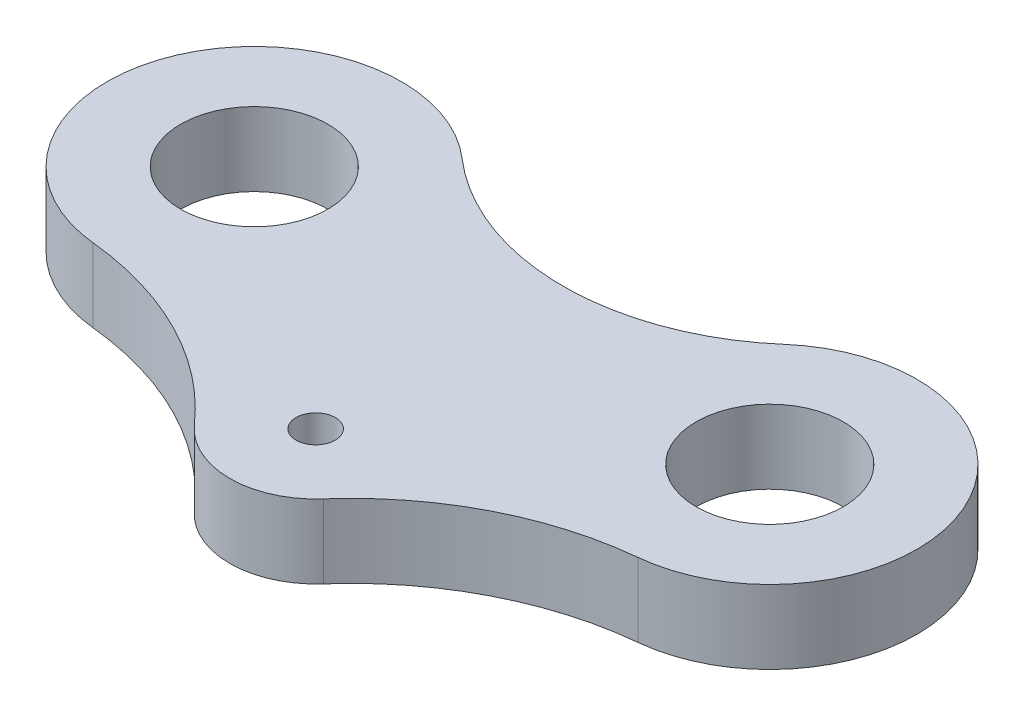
ISO-10303-21;
HEADER;
FILE_DESCRIPTION(('STEP AP214'),'2;1');
FILE_NAME('part.step','',(''),(''),'','','');
FILE_SCHEMA(('AUTOMOTIVE_DESIGN { 1 0 10303 214 1 1 1 1 }'));
ENDSEC;
DATA;
#1=APPLICATION_CONTEXT('core data for automotive mechanical design processes');
#2=APPLICATION_PROTOCOL_DEFINITION('international standard','automotive_design',2000,#1);
#3=PRODUCT_CONTEXT('',#1,'mechanical');
#4=PRODUCT('Part','Part','',(#3));
#5=PRODUCT_RELATED_PRODUCT_CATEGORY('part','',(#4));
#6=PRODUCT_DEFINITION_FORMATION('','',#4);
#7=PRODUCT_DEFINITION_CONTEXT('part definition',#1,'design');
#8=PRODUCT_DEFINITION('design','',#6,#7);
#9=PRODUCT_DEFINITION_SHAPE('','',#8);
#10=(LENGTH_UNIT() NAMED_UNIT(*) SI_UNIT(.MILLI.,.METRE.));
#11=(NAMED_UNIT(*) PLANE_ANGLE_UNIT() SI_UNIT($,.RADIAN.));
#12=(NAMED_UNIT(*) SI_UNIT($,.STERADIAN.) SOLID_ANGLE_UNIT());
#13=UNCERTAINTY_MEASURE_WITH_UNIT(LENGTH_MEASURE(1.E-05),#10,'distance_accuracy_value','');
#14=(GEOMETRIC_REPRESENTATION_CONTEXT(3) GLOBAL_UNCERTAINTY_ASSIGNED_CONTEXT((#13)) GLOBAL_UNIT_ASSIGNED_CONTEXT((#10,
#11,#12)) REPRESENTATION_CONTEXT('',''));
#15=CARTESIAN_POINT('',(0.,0.,0.));
#16=DIRECTION('',(0.,0.,1.));
#17=DIRECTION('',(1.,0.,0.));
#18=AXIS2_PLACEMENT_3D('',#15,#16,#17);
#19=CARTESIAN_POINT('',(26.2500000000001,15.0000000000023,-30.1817411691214));
#20=DIRECTION('',(0.,1.,0.));
#21=DIRECTION('',(0.,0.,1.));
#22=AXIS2_PLACEMENT_3D('',#19,#20,#21);
#23=PLANE('',#22);
#24=CARTESIAN_POINT('',(52.5000000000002,15.0000000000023,5.32907051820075E-12));
#25=DIRECTION('',(0.,1.,0.));
#26=DIRECTION('',(0.,0.,1.));
#27=AXIS2_PLACEMENT_3D('',#24,#25,#26);
#28=CIRCLE('',#27,15.);
#29=CARTESIAN_POINT('',(52.5000000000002,15.0000000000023,15.0000000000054));
#30=VERTEX_POINT('',#29);
#31=EDGE_CURVE('E183',#30,#30,#28,.T.);
#32=ORIENTED_EDGE('',*,*,#31,.F.);
#33=EDGE_LOOP('',(#32));
#34=FACE_BOUND('',#33,.T.);
#35=CARTESIAN_POINT('',(0.,15.0000000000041,-60.3634823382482));
#36=DIRECTION('',(0.,-1.,0.));
#37=DIRECTION('',(0.,0.,1.));
#38=AXIS2_PLACEMENT_3D('',#35,#36,#37);
#39=CIRCLE('',#38,50.);
#40=CARTESIAN_POINT('',(32.8125000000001,15.0000000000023,-22.6363058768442));
#41=VERTEX_POINT('',#40);
#42=CARTESIAN_POINT('',(-32.8125000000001,15.0000000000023,-22.6363058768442));
#43=VERTEX_POINT('',#42);
#44=EDGE_CURVE('E127',#41,#43,#39,.T.);
#45=ORIENTED_EDGE('',*,*,#44,.T.);
#46=CARTESIAN_POINT('',(-52.5000000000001,15.0000000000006,1.77635683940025E-12));
#47=DIRECTION('',(0.,1.,0.));
#48=DIRECTION('',(0.,0.,1.));
#49=AXIS2_PLACEMENT_3D('',#46,#47,#48);
#50=CIRCLE('',#49,30.);
#51=CARTESIAN_POINT('',(-55.47038996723,14.9999999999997,29.8525842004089));
#52=VERTEX_POINT('',#51);
#53=EDGE_CURVE('E85',#43,#52,#50,.T.);
#54=ORIENTED_EDGE('',*,*,#53,.T.);
#55=CARTESIAN_POINT('',(-61.9062348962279,15.0000000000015,94.5331833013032));
#56=DIRECTION('',(0.,-1.,0.));
#57=DIRECTION('',(0.,0.,1.));
#58=AXIS2_PLACEMENT_3D('',#55,#56,#57);
#59=CIRCLE('',#58,65.);
#60=CARTESIAN_POINT('',(-13.1316255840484,14.9999999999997,51.567644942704));
#61=VERTEX_POINT('',#60);
#62=EDGE_CURVE('E98',#52,#61,#59,.T.);
#63=ORIENTED_EDGE('',*,*,#62,.T.);
#64=CARTESIAN_POINT('',(0.,15.0000000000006,40.0000000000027));
#65=DIRECTION('',(0.,1.,0.));
#66=DIRECTION('',(0.,0.,1.));
#67=AXIS2_PLACEMENT_3D('',#64,#65,#66);
#68=CIRCLE('',#67,17.5);
#69=CARTESIAN_POINT('',(13.1316255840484,14.9999999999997,51.567644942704));
#70=VERTEX_POINT('',#69);
#71=EDGE_CURVE('E92',#61,#70,#68,.T.);
#72=ORIENTED_EDGE('',*,*,#71,.T.);
#73=CARTESIAN_POINT('',(61.9062348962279,15.0000000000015,94.5331833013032));
#74=DIRECTION('',(0.,-1.,0.));
#75=DIRECTION('',(0.,0.,1.));
#76=AXIS2_PLACEMENT_3D('',#73,#74,#75);
#77=CIRCLE('',#76,65.);
#78=CARTESIAN_POINT('',(55.47038996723,15.0000000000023,29.8525842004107));
#79=VERTEX_POINT('',#78);
#80=EDGE_CURVE('E96',#70,#79,#77,.T.);
#81=ORIENTED_EDGE('',*,*,#80,.T.);
#82=CARTESIAN_POINT('',(52.5000000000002,15.0000000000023,5.32907051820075E-12));
#83=DIRECTION('',(0.,1.,0.));
#84=DIRECTION('',(0.,0.,1.));
#85=AXIS2_PLACEMENT_3D('',#82,#83,#84);
#86=CIRCLE('',#85,30.);
#87=EDGE_CURVE('E48',#79,#41,#86,.T.);
#88=ORIENTED_EDGE('',*,*,#87,.T.);
#89=EDGE_LOOP('',(#45,#54,#63,#72,#81,#88));
#90=FACE_BOUND('',#89,.T.);
#91=CARTESIAN_POINT('',(-52.5000000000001,15.0000000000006,1.77635683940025E-12));
#92=DIRECTION('',(0.,1.,0.));
#93=DIRECTION('',(0.,0.,1.));
#94=AXIS2_PLACEMENT_3D('',#91,#92,#93);
#95=CIRCLE('',#94,15.);
#96=CARTESIAN_POINT('',(-52.5000000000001,15.0000000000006,15.0000000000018));
#97=VERTEX_POINT('',#96);
#98=EDGE_CURVE('E120',#97,#97,#95,.T.);
#99=ORIENTED_EDGE('',*,*,#98,.F.);
#100=EDGE_LOOP('',(#99));
#101=FACE_BOUND('',#100,.T.);
#102=CARTESIAN_POINT('',(0.,15.0000000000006,40.0000000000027));
#103=DIRECTION('',(0.,1.,0.));
#104=DIRECTION('',(0.,0.,1.));
#105=AXIS2_PLACEMENT_3D('',#102,#103,#104);
#106=CIRCLE('',#105,4.);
#107=CARTESIAN_POINT('',(0.,15.0000000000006,44.0000000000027));
#108=VERTEX_POINT('',#107);
#109=EDGE_CURVE('E174',#108,#108,#106,.T.);
#110=ORIENTED_EDGE('',*,*,#109,.F.);
#111=EDGE_LOOP('',(#110));
#112=FACE_BOUND('',#111,.T.);
#113=ADVANCED_FACE('F31',(#34,#90,#101,#112),#23,.T.);
#114=CARTESIAN_POINT('',(26.2500000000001,2.66453525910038E-12,-30.1817411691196));
#115=DIRECTION('',(0.,1.,0.));
#116=DIRECTION('',(0.,0.,1.));
#117=AXIS2_PLACEMENT_3D('',#114,#115,#116);
#118=PLANE('',#117);
#119=CARTESIAN_POINT('',(52.5000000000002,0.,0.));
#120=DIRECTION('',(0.,1.,0.));
#121=DIRECTION('',(0.,0.,1.));
#122=AXIS2_PLACEMENT_3D('',#119,#120,#121);
#123=CIRCLE('',#122,15.);
#124=CARTESIAN_POINT('',(52.5000000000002,0.,15.));
#125=VERTEX_POINT('',#124);
#126=EDGE_CURVE('E180',#125,#125,#123,.T.);
#127=ORIENTED_EDGE('',*,*,#126,.T.);
#128=EDGE_LOOP('',(#127));
#129=FACE_BOUND('',#128,.T.);
#130=CARTESIAN_POINT('',(0.,8.88178419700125E-13,-60.3634823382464));
#131=DIRECTION('',(0.,-1.,0.));
#132=DIRECTION('',(0.,0.,1.));
#133=AXIS2_PLACEMENT_3D('',#130,#131,#132);
#134=CIRCLE('',#133,50.);
#135=CARTESIAN_POINT('',(32.8125000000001,1.77635683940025E-12,-22.6363058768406));
#136=VERTEX_POINT('',#135);
#137=CARTESIAN_POINT('',(-32.8125000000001,1.77635683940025E-12,-22.6363058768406));
#138=VERTEX_POINT('',#137);
#139=EDGE_CURVE('E116',#136,#138,#134,.T.);
#140=ORIENTED_EDGE('',*,*,#139,.F.);
#141=CARTESIAN_POINT('',(52.5000000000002,0.,0.));
#142=DIRECTION('',(0.,1.,0.));
#143=DIRECTION('',(0.,0.,1.));
#144=AXIS2_PLACEMENT_3D('',#141,#142,#143);
#145=CIRCLE('',#144,30.);
#146=CARTESIAN_POINT('',(55.47038996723,8.88178419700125E-13,29.8525842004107));
#147=VERTEX_POINT('',#146);
#148=EDGE_CURVE('E77',#147,#136,#145,.T.);
#149=ORIENTED_EDGE('',*,*,#148,.F.);
#150=CARTESIAN_POINT('',(61.906234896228,1.77635683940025E-12,94.533183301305));
#151=DIRECTION('',(0.,-1.,0.));
#152=DIRECTION('',(0.,0.,1.));
#153=AXIS2_PLACEMENT_3D('',#150,#151,#152);
#154=CIRCLE('',#153,65.);
#155=CARTESIAN_POINT('',(13.1316255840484,1.77635683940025E-12,51.5676449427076));
#156=VERTEX_POINT('',#155);
#157=EDGE_CURVE('E71',#156,#147,#154,.T.);
#158=ORIENTED_EDGE('',*,*,#157,.F.);
#159=CARTESIAN_POINT('',(0.,2.66453525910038E-12,40.0000000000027));
#160=DIRECTION('',(0.,1.,0.));
#161=DIRECTION('',(0.,0.,1.));
#162=AXIS2_PLACEMENT_3D('',#159,#160,#161);
#163=CIRCLE('',#162,17.5);
#164=CARTESIAN_POINT('',(-13.1316255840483,1.77635683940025E-12,51.5676449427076));
#165=VERTEX_POINT('',#164);
#166=EDGE_CURVE('E106',#165,#156,#163,.T.);
#167=ORIENTED_EDGE('',*,*,#166,.F.);
#168=CARTESIAN_POINT('',(-61.9062348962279,1.77635683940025E-12,94.533183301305));
#169=DIRECTION('',(0.,-1.,0.));
#170=DIRECTION('',(0.,0.,1.));
#171=AXIS2_PLACEMENT_3D('',#168,#169,#170);
#172=CIRCLE('',#171,65.);
#173=CARTESIAN_POINT('',(-55.47038996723,1.77635683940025E-12,29.852584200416));
#174=VERTEX_POINT('',#173);
#175=EDGE_CURVE('E122',#174,#165,#172,.T.);
#176=ORIENTED_EDGE('',*,*,#175,.F.);
#177=CARTESIAN_POINT('',(-52.5000000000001,0.,0.));
#178=DIRECTION('',(0.,1.,0.));
#179=DIRECTION('',(0.,0.,1.));
#180=AXIS2_PLACEMENT_3D('',#177,#178,#179);
#181=CIRCLE('',#180,30.);
#182=EDGE_CURVE('E119',#138,#174,#181,.T.);
#183=ORIENTED_EDGE('',*,*,#182,.F.);
#184=EDGE_LOOP('',(#140,#149,#158,#167,#176,#183));
#185=FACE_BOUND('',#184,.T.);
#186=CARTESIAN_POINT('',(-52.5000000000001,0.,0.));
#187=DIRECTION('',(0.,1.,0.));
#188=DIRECTION('',(0.,0.,1.));
#189=AXIS2_PLACEMENT_3D('',#186,#187,#188);
#190=CIRCLE('',#189,15.);
#191=CARTESIAN_POINT('',(-52.5000000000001,0.,15.));
#192=VERTEX_POINT('',#191);
#193=EDGE_CURVE('E186',#192,#192,#190,.T.);
#194=ORIENTED_EDGE('',*,*,#193,.T.);
#195=EDGE_LOOP('',(#194));
#196=FACE_BOUND('',#195,.T.);
#197=CARTESIAN_POINT('',(0.,2.66453525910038E-12,40.0000000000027));
#198=DIRECTION('',(0.,1.,0.));
#199=DIRECTION('',(0.,0.,1.));
#200=AXIS2_PLACEMENT_3D('',#197,#198,#199);
#201=CIRCLE('',#200,4.);
#202=CARTESIAN_POINT('',(0.,2.66342503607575E-12,44.0000000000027));
#203=VERTEX_POINT('',#202);
#204=EDGE_CURVE('E177',#203,#203,#201,.T.);
#205=ORIENTED_EDGE('',*,*,#204,.T.);
#206=EDGE_LOOP('',(#205));
#207=FACE_BOUND('',#206,.T.);
#208=ADVANCED_FACE('F136',(#129,#185,#196,#207),#118,.F.);
#209=CARTESIAN_POINT('',(0.,15.0000000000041,-60.3634823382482));
#210=DIRECTION('',(0.,-1.,0.));
#211=DIRECTION('',(0.,0.,-1.));
#212=AXIS2_PLACEMENT_3D('',#209,#210,#211);
#213=CYLINDRICAL_SURFACE('',#212,50.);
#214=ORIENTED_EDGE('',*,*,#139,.T.);
#215=DIRECTION('',(0.,-1.,0.));
#216=VECTOR('',#215,1.);
#217=CARTESIAN_POINT('',(-32.8125000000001,15.0000000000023,-22.6363058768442));
#218=LINE('',#217,#216);
#219=EDGE_CURVE('E11',#43,#138,#218,.T.);
#220=ORIENTED_EDGE('',*,*,#219,.F.);
#221=ORIENTED_EDGE('',*,*,#44,.F.);
#222=DIRECTION('',(0.,-1.,0.));
#223=VECTOR('',#222,1.);
#224=CARTESIAN_POINT('',(32.8125000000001,15.0000000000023,-22.6363058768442));
#225=LINE('',#224,#223);
#226=EDGE_CURVE('E112',#41,#136,#225,.T.);
#227=ORIENTED_EDGE('',*,*,#226,.T.);
#228=EDGE_LOOP('',(#214,#220,#221,#227));
#229=FACE_BOUND('',#228,.T.);
#230=ADVANCED_FACE('F33',(#229),#213,.F.);
#231=CARTESIAN_POINT('',(-52.5000000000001,15.0000000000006,1.77635683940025E-12));
#232=DIRECTION('',(0.,-1.,0.));
#233=DIRECTION('',(0.,0.,-1.));
#234=AXIS2_PLACEMENT_3D('',#231,#232,#233);
#235=CYLINDRICAL_SURFACE('',#234,30.);
#236=ORIENTED_EDGE('',*,*,#182,.T.);
#237=DIRECTION('',(0.,-1.,0.));
#238=VECTOR('',#237,1.);
#239=CARTESIAN_POINT('',(-55.47038996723,14.9999999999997,29.8525842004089));
#240=LINE('',#239,#238);
#241=EDGE_CURVE('E40',#52,#174,#240,.T.);
#242=ORIENTED_EDGE('',*,*,#241,.F.);
#243=ORIENTED_EDGE('',*,*,#53,.F.);
#244=ORIENTED_EDGE('',*,*,#219,.T.);
#245=EDGE_LOOP('',(#236,#242,#243,#244));
#246=FACE_BOUND('',#245,.T.);
#247=ADVANCED_FACE('F227',(#246),#235,.T.);
#248=CARTESIAN_POINT('',(-61.9062348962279,15.0000000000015,94.5331833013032));
#249=DIRECTION('',(0.,-1.,0.));
#250=DIRECTION('',(0.,0.,-1.));
#251=AXIS2_PLACEMENT_3D('',#248,#249,#250);
#252=CYLINDRICAL_SURFACE('',#251,65.);
#253=ORIENTED_EDGE('',*,*,#175,.T.);
#254=DIRECTION('',(0.,-1.,0.));
#255=VECTOR('',#254,1.);
#256=CARTESIAN_POINT('',(-13.1316255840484,14.9999999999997,51.567644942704));
#257=LINE('',#256,#255);
#258=EDGE_CURVE('E107',#61,#165,#257,.T.);
#259=ORIENTED_EDGE('',*,*,#258,.F.);
#260=ORIENTED_EDGE('',*,*,#62,.F.);
#261=ORIENTED_EDGE('',*,*,#241,.T.);
#262=EDGE_LOOP('',(#253,#259,#260,#261));
#263=FACE_BOUND('',#262,.T.);
#264=ADVANCED_FACE('F133',(#263),#252,.F.);
#265=CARTESIAN_POINT('',(0.,15.0000000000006,40.0000000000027));
#266=DIRECTION('',(0.,-1.,0.));
#267=DIRECTION('',(0.,0.,-1.));
#268=AXIS2_PLACEMENT_3D('',#265,#266,#267);
#269=CYLINDRICAL_SURFACE('',#268,17.5);
#270=ORIENTED_EDGE('',*,*,#166,.T.);
#271=DIRECTION('',(0.,-1.,0.));
#272=VECTOR('',#271,1.);
#273=CARTESIAN_POINT('',(13.1316255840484,14.9999999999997,51.567644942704));
#274=LINE('',#273,#272);
#275=EDGE_CURVE('E103',#70,#156,#274,.T.);
#276=ORIENTED_EDGE('',*,*,#275,.F.);
#277=ORIENTED_EDGE('',*,*,#71,.F.);
#278=ORIENTED_EDGE('',*,*,#258,.T.);
#279=EDGE_LOOP('',(#270,#276,#277,#278));
#280=FACE_BOUND('',#279,.T.);
#281=ADVANCED_FACE('F104',(#280),#269,.T.);
#282=CARTESIAN_POINT('',(61.9062348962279,15.0000000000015,94.5331833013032));
#283=DIRECTION('',(0.,-1.,0.));
#284=DIRECTION('',(0.,0.,-1.));
#285=AXIS2_PLACEMENT_3D('',#282,#283,#284);
#286=CYLINDRICAL_SURFACE('',#285,65.);
#287=ORIENTED_EDGE('',*,*,#157,.T.);
#288=DIRECTION('',(0.,-1.,0.));
#289=VECTOR('',#288,1.);
#290=CARTESIAN_POINT('',(55.47038996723,15.0000000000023,29.8525842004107));
#291=LINE('',#290,#289);
#292=EDGE_CURVE('E108',#79,#147,#291,.T.);
#293=ORIENTED_EDGE('',*,*,#292,.F.);
#294=ORIENTED_EDGE('',*,*,#80,.F.);
#295=ORIENTED_EDGE('',*,*,#275,.T.);
#296=EDGE_LOOP('',(#287,#293,#294,#295));
#297=FACE_BOUND('',#296,.T.);
#298=ADVANCED_FACE('F110',(#297),#286,.F.);
#299=CARTESIAN_POINT('',(52.5000000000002,15.0000000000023,5.32907051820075E-12));
#300=DIRECTION('',(0.,-1.,0.));
#301=DIRECTION('',(0.,0.,-1.));
#302=AXIS2_PLACEMENT_3D('',#299,#300,#301);
#303=CYLINDRICAL_SURFACE('',#302,30.);
#304=ORIENTED_EDGE('',*,*,#148,.T.);
#305=ORIENTED_EDGE('',*,*,#226,.F.);
#306=ORIENTED_EDGE('',*,*,#87,.F.);
#307=ORIENTED_EDGE('',*,*,#292,.T.);
#308=EDGE_LOOP('',(#304,#305,#306,#307));
#309=FACE_BOUND('',#308,.T.);
#310=ADVANCED_FACE('F141',(#309),#303,.T.);
#311=CARTESIAN_POINT('',(-52.5000000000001,15.0000000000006,1.77635683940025E-12));
#312=DIRECTION('',(0.,-1.,0.));
#313=DIRECTION('',(0.,0.,-1.));
#314=AXIS2_PLACEMENT_3D('',#311,#312,#313);
#315=CYLINDRICAL_SURFACE('',#314,15.);
#316=ORIENTED_EDGE('',*,*,#98,.T.);
#317=EDGE_LOOP('',(#316));
#318=FACE_BOUND('',#317,.T.);
#319=ORIENTED_EDGE('',*,*,#193,.F.);
#320=EDGE_LOOP('',(#319));
#321=FACE_BOUND('',#320,.T.);
#322=ADVANCED_FACE('F143',(#318,#321),#315,.F.);
#323=CARTESIAN_POINT('',(52.5000000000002,15.0000000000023,5.32907051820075E-12));
#324=DIRECTION('',(0.,-1.,0.));
#325=DIRECTION('',(0.,0.,-1.));
#326=AXIS2_PLACEMENT_3D('',#323,#324,#325);
#327=CYLINDRICAL_SURFACE('',#326,15.);
#328=ORIENTED_EDGE('',*,*,#31,.T.);
#329=EDGE_LOOP('',(#328));
#330=FACE_BOUND('',#329,.T.);
#331=ORIENTED_EDGE('',*,*,#126,.F.);
#332=EDGE_LOOP('',(#331));
#333=FACE_BOUND('',#332,.T.);
#334=ADVANCED_FACE('F149',(#330,#333),#327,.F.);
#335=CARTESIAN_POINT('',(0.,15.0000000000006,40.0000000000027));
#336=DIRECTION('',(0.,-1.,0.));
#337=DIRECTION('',(0.,0.,-1.));
#338=AXIS2_PLACEMENT_3D('',#335,#336,#337);
#339=CYLINDRICAL_SURFACE('',#338,4.);
#340=ORIENTED_EDGE('',*,*,#109,.T.);
#341=EDGE_LOOP('',(#340));
#342=FACE_BOUND('',#341,.T.);
#343=ORIENTED_EDGE('',*,*,#204,.F.);
#344=EDGE_LOOP('',(#343));
#345=FACE_BOUND('',#344,.T.);
#346=ADVANCED_FACE('F165',(#342,#345),#339,.F.);
#347=CLOSED_SHELL('',(#113,#208,#230,#247,#264,#281,#298,#310,#322,#334,#346));
#348=MANIFOLD_SOLID_BREP('B2',#347);
#349=ADVANCED_BREP_SHAPE_REPRESENTATION('',(#18,#348),#14);
#350=SHAPE_DEFINITION_REPRESENTATION(#9,#349);
ENDSEC;
END-ISO-10303-21;
